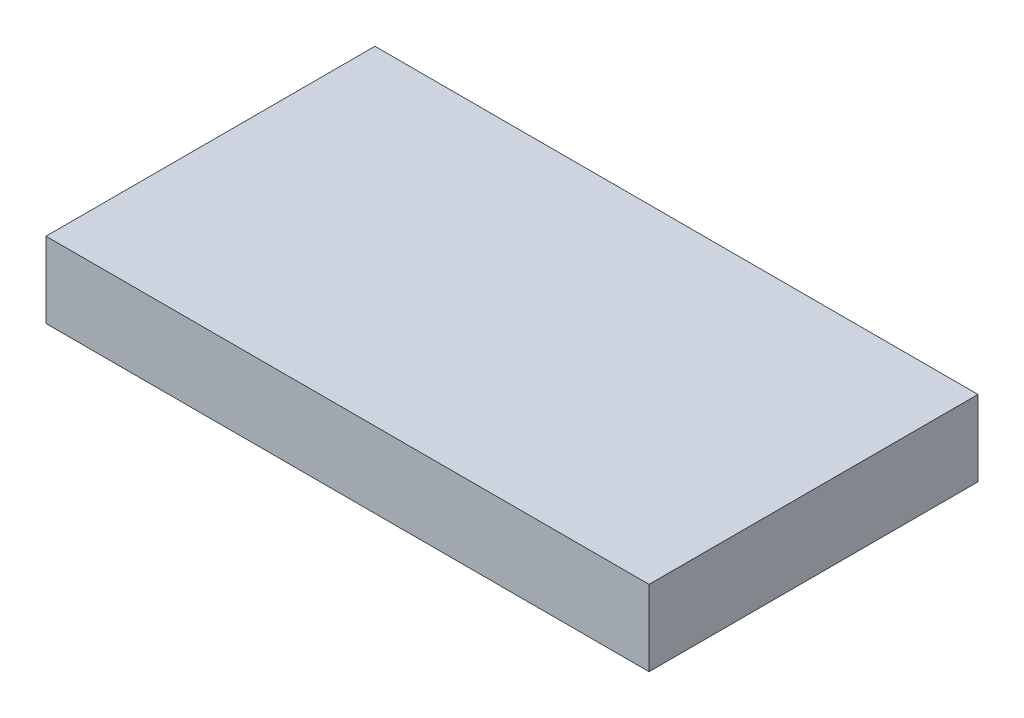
ISO-10303-21;
HEADER;
FILE_DESCRIPTION(('STEP AP214'),'2;1');
FILE_NAME('part.step','',(''),(''),'','','');
FILE_SCHEMA(('AUTOMOTIVE_DESIGN { 1 0 10303 214 1 1 1 1 }'));
ENDSEC;
DATA;
#1=APPLICATION_CONTEXT('core data for automotive mechanical design processes');
#2=APPLICATION_PROTOCOL_DEFINITION('international standard','automotive_design',2000,#1);
#3=PRODUCT_CONTEXT('',#1,'mechanical');
#4=PRODUCT('Part','Part','',(#3));
#5=PRODUCT_RELATED_PRODUCT_CATEGORY('part','',(#4));
#6=PRODUCT_DEFINITION_FORMATION('','',#4);
#7=PRODUCT_DEFINITION_CONTEXT('part definition',#1,'design');
#8=PRODUCT_DEFINITION('design','',#6,#7);
#9=PRODUCT_DEFINITION_SHAPE('','',#8);
#10=(LENGTH_UNIT() NAMED_UNIT(*) SI_UNIT(.MILLI.,.METRE.));
#11=(NAMED_UNIT(*) PLANE_ANGLE_UNIT() SI_UNIT($,.RADIAN.));
#12=(NAMED_UNIT(*) SI_UNIT($,.STERADIAN.) SOLID_ANGLE_UNIT());
#13=UNCERTAINTY_MEASURE_WITH_UNIT(LENGTH_MEASURE(1.E-05),#10,'distance_accuracy_value','');
#14=(GEOMETRIC_REPRESENTATION_CONTEXT(3) GLOBAL_UNCERTAINTY_ASSIGNED_CONTEXT((#13)) GLOBAL_UNIT_ASSIGNED_CONTEXT((#10,
#11,#12)) REPRESENTATION_CONTEXT('',''));
#15=CARTESIAN_POINT('',(0.,0.,0.));
#16=DIRECTION('',(0.,0.,1.));
#17=DIRECTION('',(1.,0.,0.));
#18=AXIS2_PLACEMENT_3D('',#15,#16,#17);
#19=CARTESIAN_POINT('',(0.,8.763,0.));
#20=DIRECTION('',(1.,0.,0.));
#21=DIRECTION('',(0.,0.,-1.));
#22=AXIS2_PLACEMENT_3D('',#19,#20,#21);
#23=PLANE('',#22);
#24=DIRECTION('',(0.,0.,1.));
#25=VECTOR('',#24,1.);
#26=CARTESIAN_POINT('',(0.,0.,0.));
#27=LINE('',#26,#25);
#28=CARTESIAN_POINT('',(0.,0.,-38.1));
#29=VERTEX_POINT('',#28);
#30=CARTESIAN_POINT('',(0.,0.,0.));
#31=VERTEX_POINT('',#30);
#32=EDGE_CURVE('E95',#29,#31,#27,.T.);
#33=ORIENTED_EDGE('',*,*,#32,.T.);
#34=DIRECTION('',(0.,-1.,0.));
#35=VECTOR('',#34,1.);
#36=CARTESIAN_POINT('',(0.,8.763,0.));
#37=LINE('',#36,#35);
#38=CARTESIAN_POINT('',(0.,8.763,0.));
#39=VERTEX_POINT('',#38);
#40=EDGE_CURVE('E11',#39,#31,#37,.T.);
#41=ORIENTED_EDGE('',*,*,#40,.F.);
#42=DIRECTION('',(0.,0.,1.));
#43=VECTOR('',#42,1.);
#44=CARTESIAN_POINT('',(0.,8.763,0.));
#45=LINE('',#44,#43);
#46=CARTESIAN_POINT('',(0.,8.763,-38.1));
#47=VERTEX_POINT('',#46);
#48=EDGE_CURVE('E83',#47,#39,#45,.T.);
#49=ORIENTED_EDGE('',*,*,#48,.F.);
#50=DIRECTION('',(0.,-1.,0.));
#51=VECTOR('',#50,1.);
#52=CARTESIAN_POINT('',(0.,8.763,-38.1));
#53=LINE('',#52,#51);
#54=EDGE_CURVE('E91',#47,#29,#53,.T.);
#55=ORIENTED_EDGE('',*,*,#54,.T.);
#56=EDGE_LOOP('',(#33,#41,#49,#55));
#57=FACE_BOUND('',#56,.T.);
#58=ADVANCED_FACE('F32',(#57),#23,.F.);
#59=CARTESIAN_POINT('',(0.,8.763,0.));
#60=DIRECTION('',(0.,0.,-1.));
#61=DIRECTION('',(-1.,0.,0.));
#62=AXIS2_PLACEMENT_3D('',#59,#60,#61);
#63=PLANE('',#62);
#64=DIRECTION('',(1.,0.,0.));
#65=VECTOR('',#64,1.);
#66=CARTESIAN_POINT('',(0.,0.,0.));
#67=LINE('',#66,#65);
#68=CARTESIAN_POINT('',(69.85,0.,0.));
#69=VERTEX_POINT('',#68);
#70=EDGE_CURVE('E87',#31,#69,#67,.T.);
#71=ORIENTED_EDGE('',*,*,#70,.T.);
#72=DIRECTION('',(0.,-1.,0.));
#73=VECTOR('',#72,1.);
#74=CARTESIAN_POINT('',(69.85,8.763,0.));
#75=LINE('',#74,#73);
#76=CARTESIAN_POINT('',(69.85,8.763,0.));
#77=VERTEX_POINT('',#76);
#78=EDGE_CURVE('E40',#77,#69,#75,.T.);
#79=ORIENTED_EDGE('',*,*,#78,.F.);
#80=DIRECTION('',(1.,0.,0.));
#81=VECTOR('',#80,1.);
#82=CARTESIAN_POINT('',(0.,8.763,0.));
#83=LINE('',#82,#81);
#84=EDGE_CURVE('E78',#39,#77,#83,.T.);
#85=ORIENTED_EDGE('',*,*,#84,.F.);
#86=ORIENTED_EDGE('',*,*,#40,.T.);
#87=EDGE_LOOP('',(#71,#79,#85,#86));
#88=FACE_BOUND('',#87,.T.);
#89=ADVANCED_FACE('F86',(#88),#63,.F.);
#90=CARTESIAN_POINT('',(69.85,8.763,0.));
#91=DIRECTION('',(-1.,0.,0.));
#92=DIRECTION('',(0.,0.,1.));
#93=AXIS2_PLACEMENT_3D('',#90,#91,#92);
#94=PLANE('',#93);
#95=DIRECTION('',(0.,0.,-1.));
#96=VECTOR('',#95,1.);
#97=CARTESIAN_POINT('',(69.85,0.,0.));
#98=LINE('',#97,#96);
#99=CARTESIAN_POINT('',(69.85,0.,-38.1));
#100=VERTEX_POINT('',#99);
#101=EDGE_CURVE('E65',#69,#100,#98,.T.);
#102=ORIENTED_EDGE('',*,*,#101,.T.);
#103=DIRECTION('',(0.,-1.,0.));
#104=VECTOR('',#103,1.);
#105=CARTESIAN_POINT('',(69.85,8.763,-38.1));
#106=LINE('',#105,#104);
#107=CARTESIAN_POINT('',(69.85,8.763,-38.1));
#108=VERTEX_POINT('',#107);
#109=EDGE_CURVE('E88',#108,#100,#106,.T.);
#110=ORIENTED_EDGE('',*,*,#109,.F.);
#111=DIRECTION('',(0.,0.,-1.));
#112=VECTOR('',#111,1.);
#113=CARTESIAN_POINT('',(69.85,8.763,0.));
#114=LINE('',#113,#112);
#115=EDGE_CURVE('E81',#77,#108,#114,.T.);
#116=ORIENTED_EDGE('',*,*,#115,.F.);
#117=ORIENTED_EDGE('',*,*,#78,.T.);
#118=EDGE_LOOP('',(#102,#110,#116,#117));
#119=FACE_BOUND('',#118,.T.);
#120=ADVANCED_FACE('F89',(#119),#94,.F.);
#121=CARTESIAN_POINT('',(0.,8.763,-38.1));
#122=DIRECTION('',(0.,0.,1.));
#123=DIRECTION('',(1.,0.,0.));
#124=AXIS2_PLACEMENT_3D('',#121,#122,#123);
#125=PLANE('',#124);
#126=DIRECTION('',(-1.,0.,0.));
#127=VECTOR('',#126,1.);
#128=CARTESIAN_POINT('',(0.,0.,-38.1));
#129=LINE('',#128,#127);
#130=EDGE_CURVE('E71',#100,#29,#129,.T.);
#131=ORIENTED_EDGE('',*,*,#130,.T.);
#132=ORIENTED_EDGE('',*,*,#54,.F.);
#133=DIRECTION('',(-1.,0.,0.));
#134=VECTOR('',#133,1.);
#135=CARTESIAN_POINT('',(0.,8.763,-38.1));
#136=LINE('',#135,#134);
#137=EDGE_CURVE('E48',#108,#47,#136,.T.);
#138=ORIENTED_EDGE('',*,*,#137,.F.);
#139=ORIENTED_EDGE('',*,*,#109,.T.);
#140=EDGE_LOOP('',(#131,#132,#138,#139));
#141=FACE_BOUND('',#140,.T.);
#142=ADVANCED_FACE('F102',(#141),#125,.F.);
#143=CARTESIAN_POINT('',(0.,8.763,-38.1));
#144=DIRECTION('',(0.,-1.,0.));
#145=DIRECTION('',(0.,0.,-1.));
#146=AXIS2_PLACEMENT_3D('',#143,#144,#145);
#147=PLANE('',#146);
#148=ORIENTED_EDGE('',*,*,#48,.T.);
#149=ORIENTED_EDGE('',*,*,#84,.T.);
#150=ORIENTED_EDGE('',*,*,#115,.T.);
#151=ORIENTED_EDGE('',*,*,#137,.T.);
#152=EDGE_LOOP('',(#148,#149,#150,#151));
#153=FACE_BOUND('',#152,.T.);
#154=ADVANCED_FACE('F79',(#153),#147,.F.);
#155=CARTESIAN_POINT('',(0.,0.,-38.1));
#156=DIRECTION('',(0.,-1.,0.));
#157=DIRECTION('',(0.,0.,-1.));
#158=AXIS2_PLACEMENT_3D('',#155,#156,#157);
#159=PLANE('',#158);
#160=ORIENTED_EDGE('',*,*,#32,.F.);
#161=ORIENTED_EDGE('',*,*,#130,.F.);
#162=ORIENTED_EDGE('',*,*,#101,.F.);
#163=ORIENTED_EDGE('',*,*,#70,.F.);
#164=EDGE_LOOP('',(#160,#161,#162,#163));
#165=FACE_BOUND('',#164,.T.);
#166=ADVANCED_FACE('F105',(#165),#159,.T.);
#167=CLOSED_SHELL('',(#58,#89,#120,#142,#154,#166));
#168=MANIFOLD_SOLID_BREP('B2',#167);
#169=ADVANCED_BREP_SHAPE_REPRESENTATION('',(#18,#168),#14);
#170=SHAPE_DEFINITION_REPRESENTATION(#9,#169);
ENDSEC;
END-ISO-10303-21;
